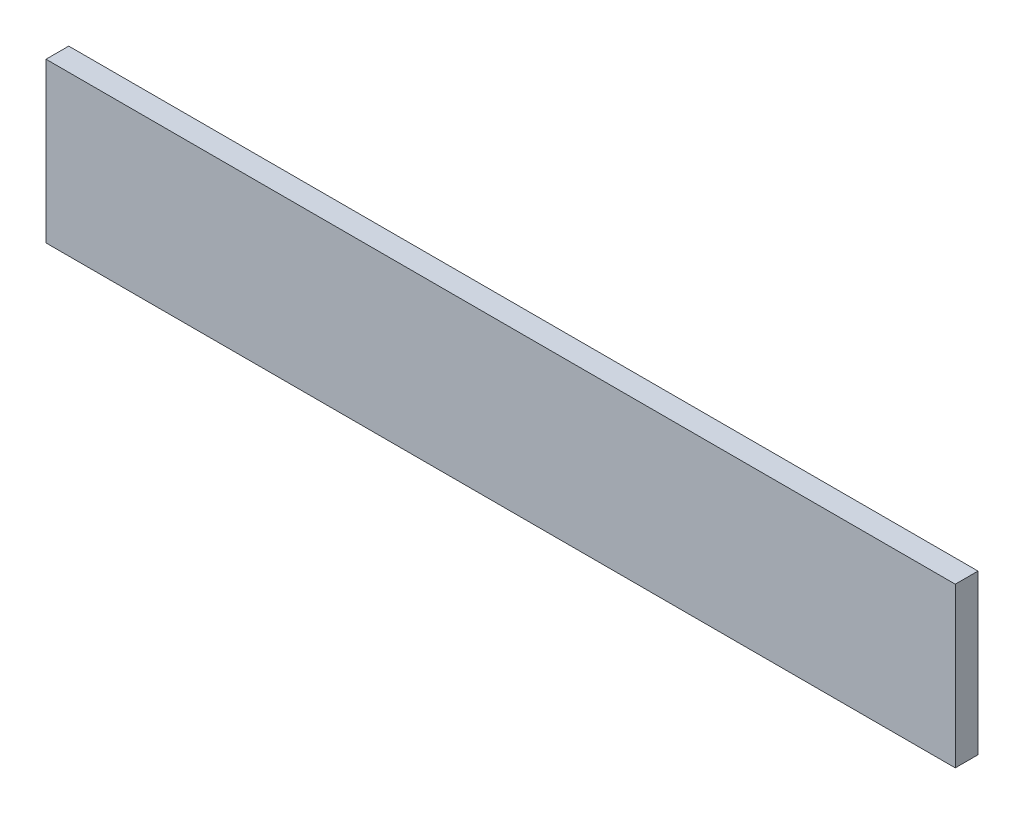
from build123d import *

# Parameters (mm, degrees)
SKETCH1_W           = 254
SKETCH1_H           = 44.45
BOSS_EXTRUDE1_DEPTH = 6.35


with BuildPart() as part:
    # Sketch1 → Boss-Extrude1 (new body)
    with BuildSketch(Plane.XY):
        with Locations((127, 22.225)):
            Rectangle(SKETCH1_W, SKETCH1_H)
    extrude(amount=BOSS_EXTRUDE1_DEPTH)


solid = part.part
